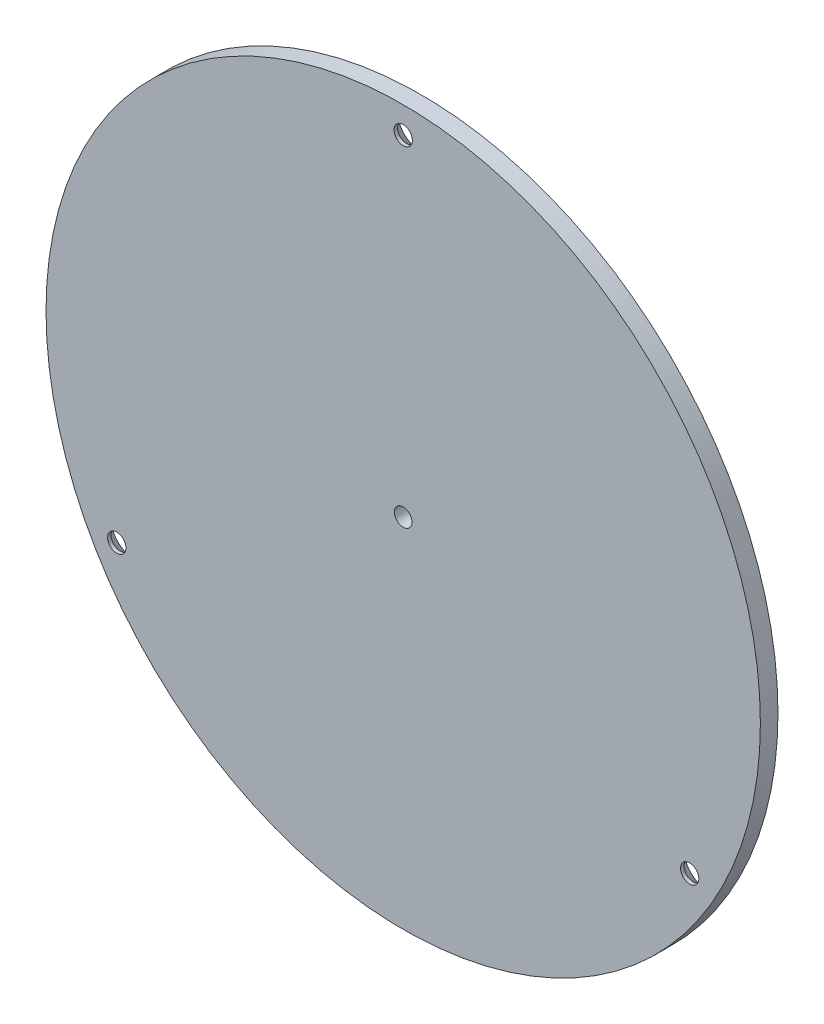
ISO-10303-21;
HEADER;
FILE_DESCRIPTION(('STEP AP214'),'2;1');
FILE_NAME('part.step','',(''),(''),'','','');
FILE_SCHEMA(('AUTOMOTIVE_DESIGN { 1 0 10303 214 1 1 1 1 }'));
ENDSEC;
DATA;
#1=APPLICATION_CONTEXT('core data for automotive mechanical design processes');
#2=APPLICATION_PROTOCOL_DEFINITION('international standard','automotive_design',2000,#1);
#3=PRODUCT_CONTEXT('',#1,'mechanical');
#4=PRODUCT('Part','Part','',(#3));
#5=PRODUCT_RELATED_PRODUCT_CATEGORY('part','',(#4));
#6=PRODUCT_DEFINITION_FORMATION('','',#4);
#7=PRODUCT_DEFINITION_CONTEXT('part definition',#1,'design');
#8=PRODUCT_DEFINITION('design','',#6,#7);
#9=PRODUCT_DEFINITION_SHAPE('','',#8);
#10=(LENGTH_UNIT() NAMED_UNIT(*) SI_UNIT(.MILLI.,.METRE.));
#11=(NAMED_UNIT(*) PLANE_ANGLE_UNIT() SI_UNIT($,.RADIAN.));
#12=(NAMED_UNIT(*) SI_UNIT($,.STERADIAN.) SOLID_ANGLE_UNIT());
#13=UNCERTAINTY_MEASURE_WITH_UNIT(LENGTH_MEASURE(1.E-05),#10,'distance_accuracy_value','');
#14=(GEOMETRIC_REPRESENTATION_CONTEXT(3) GLOBAL_UNCERTAINTY_ASSIGNED_CONTEXT((#13)) GLOBAL_UNIT_ASSIGNED_CONTEXT((#10,
#11,#12)) REPRESENTATION_CONTEXT('',''));
#15=CARTESIAN_POINT('',(0.,0.,0.));
#16=DIRECTION('',(0.,0.,1.));
#17=DIRECTION('',(1.,0.,0.));
#18=AXIS2_PLACEMENT_3D('',#15,#16,#17);
#19=CARTESIAN_POINT('',(0.,0.,5.));
#20=DIRECTION('',(0.,0.,-1.));
#21=DIRECTION('',(-1.,0.,0.));
#22=AXIS2_PLACEMENT_3D('',#19,#20,#21);
#23=CYLINDRICAL_SURFACE('',#22,101.5);
#24=CARTESIAN_POINT('',(0.,0.,5.));
#25=DIRECTION('',(0.,0.,1.));
#26=DIRECTION('',(1.,0.,0.));
#27=AXIS2_PLACEMENT_3D('',#24,#25,#26);
#28=CIRCLE('',#27,101.5);
#29=CARTESIAN_POINT('',(101.5,0.,5.));
#30=VERTEX_POINT('',#29);
#31=EDGE_CURVE('E75',#30,#30,#28,.T.);
#32=ORIENTED_EDGE('',*,*,#31,.F.);
#33=EDGE_LOOP('',(#32));
#34=FACE_BOUND('',#33,.T.);
#35=CARTESIAN_POINT('',(0.,0.,0.));
#36=DIRECTION('',(0.,0.,1.));
#37=DIRECTION('',(1.,0.,0.));
#38=AXIS2_PLACEMENT_3D('',#35,#36,#37);
#39=CIRCLE('',#38,101.5);
#40=CARTESIAN_POINT('',(101.5,0.,0.));
#41=VERTEX_POINT('',#40);
#42=EDGE_CURVE('E76',#41,#41,#39,.T.);
#43=ORIENTED_EDGE('',*,*,#42,.T.);
#44=EDGE_LOOP('',(#43));
#45=FACE_BOUND('',#44,.T.);
#46=ADVANCED_FACE('F41',(#34,#45),#23,.T.);
#47=CARTESIAN_POINT('',(0.,0.,5.));
#48=DIRECTION('',(0.,0.,1.));
#49=DIRECTION('',(1.,0.,0.));
#50=AXIS2_PLACEMENT_3D('',#47,#48,#49);
#51=PLANE('',#50);
#52=CARTESIAN_POINT('',(-81.406387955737,-47.0000000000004,5.));
#53=DIRECTION('',(0.,0.,1.));
#54=DIRECTION('',(1.,0.,0.));
#55=AXIS2_PLACEMENT_3D('',#52,#53,#54);
#56=CIRCLE('',#55,2.6);
#57=CARTESIAN_POINT('',(-78.806387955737,-47.0000000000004,5.));
#58=VERTEX_POINT('',#57);
#59=EDGE_CURVE('E91',#58,#58,#56,.T.);
#60=ORIENTED_EDGE('',*,*,#59,.F.);
#61=EDGE_LOOP('',(#60));
#62=FACE_BOUND('',#61,.T.);
#63=CARTESIAN_POINT('',(81.406387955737,-47.0000000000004,5.));
#64=DIRECTION('',(0.,0.,1.));
#65=DIRECTION('',(1.,0.,0.));
#66=AXIS2_PLACEMENT_3D('',#63,#64,#65);
#67=CIRCLE('',#66,2.6);
#68=CARTESIAN_POINT('',(84.006387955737,-47.0000000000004,5.));
#69=VERTEX_POINT('',#68);
#70=EDGE_CURVE('E94',#69,#69,#67,.T.);
#71=ORIENTED_EDGE('',*,*,#70,.F.);
#72=EDGE_LOOP('',(#71));
#73=FACE_BOUND('',#72,.T.);
#74=CARTESIAN_POINT('',(0.,94.,5.));
#75=DIRECTION('',(0.,0.,1.));
#76=DIRECTION('',(1.,0.,0.));
#77=AXIS2_PLACEMENT_3D('',#74,#75,#76);
#78=CIRCLE('',#77,2.6);
#79=CARTESIAN_POINT('',(2.6,94.,5.));
#80=VERTEX_POINT('',#79);
#81=EDGE_CURVE('E87',#80,#80,#78,.T.);
#82=ORIENTED_EDGE('',*,*,#81,.F.);
#83=EDGE_LOOP('',(#82));
#84=FACE_BOUND('',#83,.T.);
#85=CARTESIAN_POINT('',(0.,0.,5.));
#86=DIRECTION('',(0.,0.,1.));
#87=DIRECTION('',(1.,0.,0.));
#88=AXIS2_PLACEMENT_3D('',#85,#86,#87);
#89=CIRCLE('',#88,2.5);
#90=CARTESIAN_POINT('',(2.5,0.,5.));
#91=VERTEX_POINT('',#90);
#92=EDGE_CURVE('E83',#91,#91,#89,.T.);
#93=ORIENTED_EDGE('',*,*,#92,.F.);
#94=EDGE_LOOP('',(#93));
#95=FACE_BOUND('',#94,.T.);
#96=ORIENTED_EDGE('',*,*,#31,.T.);
#97=EDGE_LOOP('',(#96));
#98=FACE_BOUND('',#97,.T.);
#99=ADVANCED_FACE('F102',(#62,#73,#84,#95,#98),#51,.T.);
#100=CARTESIAN_POINT('',(0.,0.,0.));
#101=DIRECTION('',(0.,0.,1.));
#102=DIRECTION('',(1.,0.,0.));
#103=AXIS2_PLACEMENT_3D('',#100,#101,#102);
#104=PLANE('',#103);
#105=CARTESIAN_POINT('',(0.,94.,0.));
#106=DIRECTION('',(0.,0.,1.));
#107=DIRECTION('',(1.,0.,0.));
#108=AXIS2_PLACEMENT_3D('',#105,#106,#107);
#109=CIRCLE('',#108,6.59999999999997);
#110=CARTESIAN_POINT('',(6.59999999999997,94.,0.));
#111=VERTEX_POINT('',#110);
#112=EDGE_CURVE('E63',#111,#111,#109,.T.);
#113=ORIENTED_EDGE('',*,*,#112,.T.);
#114=EDGE_LOOP('',(#113));
#115=FACE_BOUND('',#114,.T.);
#116=CARTESIAN_POINT('',(-81.406387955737,-47.0000000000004,0.));
#117=DIRECTION('',(0.,0.,1.));
#118=DIRECTION('',(1.,0.,0.));
#119=AXIS2_PLACEMENT_3D('',#116,#117,#118);
#120=CIRCLE('',#119,6.60000000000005);
#121=CARTESIAN_POINT('',(-74.806387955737,-47.0000000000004,0.));
#122=VERTEX_POINT('',#121);
#123=EDGE_CURVE('E68',#122,#122,#120,.T.);
#124=ORIENTED_EDGE('',*,*,#123,.T.);
#125=EDGE_LOOP('',(#124));
#126=FACE_BOUND('',#125,.T.);
#127=CARTESIAN_POINT('',(81.406387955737,-47.0000000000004,0.));
#128=DIRECTION('',(0.,0.,1.));
#129=DIRECTION('',(1.,0.,0.));
#130=AXIS2_PLACEMENT_3D('',#127,#128,#129);
#131=CIRCLE('',#130,6.60000000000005);
#132=CARTESIAN_POINT('',(88.0063879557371,-47.0000000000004,0.));
#133=VERTEX_POINT('',#132);
#134=EDGE_CURVE('E71',#133,#133,#131,.T.);
#135=ORIENTED_EDGE('',*,*,#134,.T.);
#136=EDGE_LOOP('',(#135));
#137=FACE_BOUND('',#136,.T.);
#138=CARTESIAN_POINT('',(0.,0.,0.));
#139=DIRECTION('',(0.,0.,1.));
#140=DIRECTION('',(1.,0.,0.));
#141=AXIS2_PLACEMENT_3D('',#138,#139,#140);
#142=CIRCLE('',#141,2.5);
#143=CARTESIAN_POINT('',(2.5,0.,0.));
#144=VERTEX_POINT('',#143);
#145=EDGE_CURVE('E80',#144,#144,#142,.T.);
#146=ORIENTED_EDGE('',*,*,#145,.T.);
#147=EDGE_LOOP('',(#146));
#148=FACE_BOUND('',#147,.T.);
#149=ORIENTED_EDGE('',*,*,#42,.F.);
#150=EDGE_LOOP('',(#149));
#151=FACE_BOUND('',#150,.T.);
#152=ADVANCED_FACE('F105',(#115,#126,#137,#148,#151),#104,.F.);
#153=CARTESIAN_POINT('',(0.,0.,0.));
#154=DIRECTION('',(0.,0.,1.));
#155=DIRECTION('',(1.,0.,0.));
#156=AXIS2_PLACEMENT_3D('',#153,#154,#155);
#157=CYLINDRICAL_SURFACE('',#156,2.5);
#158=ORIENTED_EDGE('',*,*,#145,.F.);
#159=EDGE_LOOP('',(#158));
#160=FACE_BOUND('',#159,.T.);
#161=ORIENTED_EDGE('',*,*,#92,.T.);
#162=EDGE_LOOP('',(#161));
#163=FACE_BOUND('',#162,.T.);
#164=ADVANCED_FACE('F118',(#160,#163),#157,.F.);
#165=CARTESIAN_POINT('',(0.,94.,0.));
#166=DIRECTION('',(0.,0.,1.));
#167=DIRECTION('',(1.,0.,0.));
#168=AXIS2_PLACEMENT_3D('',#165,#166,#167);
#169=CYLINDRICAL_SURFACE('',#168,2.6);
#170=CARTESIAN_POINT('',(0.,94.,4.00000000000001));
#171=DIRECTION('',(0.,0.,1.));
#172=DIRECTION('',(1.,0.,0.));
#173=AXIS2_PLACEMENT_3D('',#170,#171,#172);
#174=CIRCLE('',#173,2.6);
#175=CARTESIAN_POINT('',(2.6,94.,4.00000000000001));
#176=VERTEX_POINT('',#175);
#177=EDGE_CURVE('E57',#176,#176,#174,.F.);
#178=ORIENTED_EDGE('',*,*,#177,.T.);
#179=EDGE_LOOP('',(#178));
#180=FACE_BOUND('',#179,.T.);
#181=ORIENTED_EDGE('',*,*,#81,.T.);
#182=EDGE_LOOP('',(#181));
#183=FACE_BOUND('',#182,.T.);
#184=ADVANCED_FACE('F100',(#180,#183),#169,.F.);
#185=CARTESIAN_POINT('',(81.406387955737,-47.0000000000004,0.));
#186=DIRECTION('',(0.,0.,1.));
#187=DIRECTION('',(1.,0.,0.));
#188=AXIS2_PLACEMENT_3D('',#185,#186,#187);
#189=CYLINDRICAL_SURFACE('',#188,2.6);
#190=CARTESIAN_POINT('',(81.406387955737,-47.0000000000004,4.00000000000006));
#191=DIRECTION('',(0.,0.,1.));
#192=DIRECTION('',(1.,0.,0.));
#193=AXIS2_PLACEMENT_3D('',#190,#191,#192);
#194=CIRCLE('',#193,2.6);
#195=CARTESIAN_POINT('',(84.006387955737,-47.0000000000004,4.00000000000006));
#196=VERTEX_POINT('',#195);
#197=EDGE_CURVE('E10',#196,#196,#194,.F.);
#198=ORIENTED_EDGE('',*,*,#197,.T.);
#199=EDGE_LOOP('',(#198));
#200=FACE_BOUND('',#199,.T.);
#201=ORIENTED_EDGE('',*,*,#70,.T.);
#202=EDGE_LOOP('',(#201));
#203=FACE_BOUND('',#202,.T.);
#204=ADVANCED_FACE('F178',(#200,#203),#189,.F.);
#205=CARTESIAN_POINT('',(-81.406387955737,-47.0000000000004,0.));
#206=DIRECTION('',(0.,0.,1.));
#207=DIRECTION('',(1.,0.,0.));
#208=AXIS2_PLACEMENT_3D('',#205,#206,#207);
#209=CYLINDRICAL_SURFACE('',#208,2.6);
#210=CARTESIAN_POINT('',(-81.406387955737,-47.0000000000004,4.00000000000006));
#211=DIRECTION('',(0.,0.,1.));
#212=DIRECTION('',(1.,0.,0.));
#213=AXIS2_PLACEMENT_3D('',#210,#211,#212);
#214=CIRCLE('',#213,2.6);
#215=CARTESIAN_POINT('',(-78.806387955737,-47.0000000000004,4.00000000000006));
#216=VERTEX_POINT('',#215);
#217=EDGE_CURVE('E50',#216,#216,#214,.F.);
#218=ORIENTED_EDGE('',*,*,#217,.T.);
#219=EDGE_LOOP('',(#218));
#220=FACE_BOUND('',#219,.T.);
#221=ORIENTED_EDGE('',*,*,#59,.T.);
#222=EDGE_LOOP('',(#221));
#223=FACE_BOUND('',#222,.T.);
#224=ADVANCED_FACE('F134',(#220,#223),#209,.F.);
#225=CARTESIAN_POINT('',(0.,94.,0.));
#226=DIRECTION('',(0.,0.,-1.));
#227=DIRECTION('',(-1.,0.,0.));
#228=AXIS2_PLACEMENT_3D('',#225,#226,#227);
#229=CONICAL_SURFACE('',#228,6.59999999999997,0.785398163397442);
#230=ORIENTED_EDGE('',*,*,#177,.F.);
#231=EDGE_LOOP('',(#230));
#232=FACE_BOUND('',#231,.T.);
#233=ORIENTED_EDGE('',*,*,#112,.F.);
#234=EDGE_LOOP('',(#233));
#235=FACE_BOUND('',#234,.T.);
#236=ADVANCED_FACE('F128',(#232,#235),#229,.F.);
#237=CARTESIAN_POINT('',(-81.406387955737,-47.0000000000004,0.));
#238=DIRECTION('',(0.,0.,-1.));
#239=DIRECTION('',(-1.,0.,0.));
#240=AXIS2_PLACEMENT_3D('',#237,#238,#239);
#241=CONICAL_SURFACE('',#240,6.60000000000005,0.785398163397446);
#242=ORIENTED_EDGE('',*,*,#217,.F.);
#243=EDGE_LOOP('',(#242));
#244=FACE_BOUND('',#243,.T.);
#245=ORIENTED_EDGE('',*,*,#123,.F.);
#246=EDGE_LOOP('',(#245));
#247=FACE_BOUND('',#246,.T.);
#248=ADVANCED_FACE('F133',(#244,#247),#241,.F.);
#249=CARTESIAN_POINT('',(81.406387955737,-47.0000000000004,0.));
#250=DIRECTION('',(0.,0.,-1.));
#251=DIRECTION('',(-1.,0.,0.));
#252=AXIS2_PLACEMENT_3D('',#249,#250,#251);
#253=CONICAL_SURFACE('',#252,6.60000000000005,0.785398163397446);
#254=ORIENTED_EDGE('',*,*,#197,.F.);
#255=EDGE_LOOP('',(#254));
#256=FACE_BOUND('',#255,.T.);
#257=ORIENTED_EDGE('',*,*,#134,.F.);
#258=EDGE_LOOP('',(#257));
#259=FACE_BOUND('',#258,.T.);
#260=ADVANCED_FACE('F44',(#256,#259),#253,.F.);
#261=CLOSED_SHELL('',(#46,#99,#152,#164,#184,#204,#224,#236,#248,#260));
#262=MANIFOLD_SOLID_BREP('B2',#261);
#263=ADVANCED_BREP_SHAPE_REPRESENTATION('',(#18,#262),#14);
#264=SHAPE_DEFINITION_REPRESENTATION(#9,#263);
ENDSEC;
END-ISO-10303-21;
